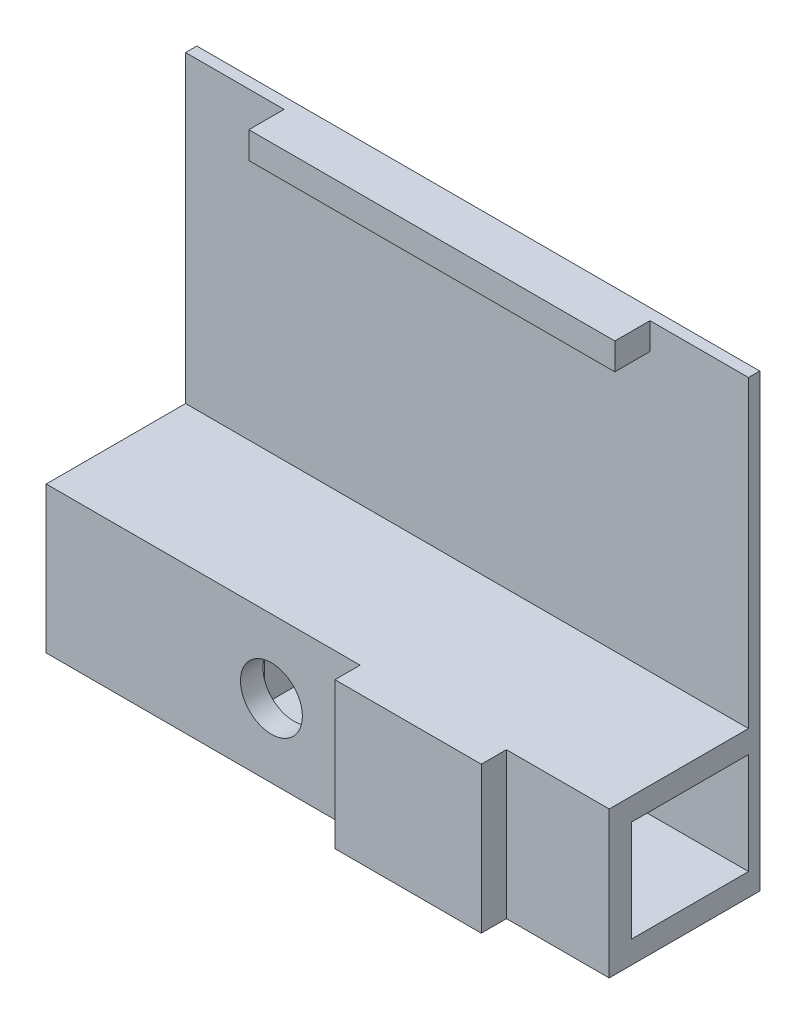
ISO-10303-21;
HEADER;
FILE_DESCRIPTION(('STEP AP214'),'2;1');
FILE_NAME('part.step','',(''),(''),'','','');
FILE_SCHEMA(('AUTOMOTIVE_DESIGN { 1 0 10303 214 1 1 1 1 }'));
ENDSEC;
DATA;
#1=APPLICATION_CONTEXT('core data for automotive mechanical design processes');
#2=APPLICATION_PROTOCOL_DEFINITION('international standard','automotive_design',2000,#1);
#3=PRODUCT_CONTEXT('',#1,'mechanical');
#4=PRODUCT('Part','Part','',(#3));
#5=PRODUCT_RELATED_PRODUCT_CATEGORY('part','',(#4));
#6=PRODUCT_DEFINITION_FORMATION('','',#4);
#7=PRODUCT_DEFINITION_CONTEXT('part definition',#1,'design');
#8=PRODUCT_DEFINITION('design','',#6,#7);
#9=PRODUCT_DEFINITION_SHAPE('','',#8);
#10=(LENGTH_UNIT() NAMED_UNIT(*) SI_UNIT(.MILLI.,.METRE.));
#11=(NAMED_UNIT(*) PLANE_ANGLE_UNIT() SI_UNIT($,.RADIAN.));
#12=(NAMED_UNIT(*) SI_UNIT($,.STERADIAN.) SOLID_ANGLE_UNIT());
#13=UNCERTAINTY_MEASURE_WITH_UNIT(LENGTH_MEASURE(1.E-05),#10,'distance_accuracy_value','');
#14=(GEOMETRIC_REPRESENTATION_CONTEXT(3) GLOBAL_UNCERTAINTY_ASSIGNED_CONTEXT((#13)) GLOBAL_UNIT_ASSIGNED_CONTEXT((#10,
#11,#12)) REPRESENTATION_CONTEXT('',''));
#15=CARTESIAN_POINT('',(0.,0.,0.));
#16=DIRECTION('',(0.,0.,1.));
#17=DIRECTION('',(1.,0.,0.));
#18=AXIS2_PLACEMENT_3D('',#15,#16,#17);
#19=CARTESIAN_POINT('',(-160.,-52.,8.));
#20=DIRECTION('',(0.,0.,1.));
#21=DIRECTION('',(1.,0.,0.));
#22=AXIS2_PLACEMENT_3D('',#19,#20,#21);
#23=PLANE('',#22);
#24=DIRECTION('',(1.,0.,0.));
#25=VECTOR('',#24,1.);
#26=CARTESIAN_POINT('',(-90.,249.,8.));
#27=LINE('',#26,#25);
#28=CARTESIAN_POINT('',(-90.,249.,8.));
#29=VERTEX_POINT('',#28);
#30=CARTESIAN_POINT('',(170.,249.,8.));
#31=VERTEX_POINT('',#30);
#32=EDGE_CURVE('E52',#29,#31,#27,.T.);
#33=ORIENTED_EDGE('',*,*,#32,.F.);
#34=DIRECTION('',(0.,-1.,0.));
#35=VECTOR('',#34,1.);
#36=CARTESIAN_POINT('',(-90.,268.,8.));
#37=LINE('',#36,#35);
#38=CARTESIAN_POINT('',(-90.,268.,8.));
#39=VERTEX_POINT('',#38);
#40=EDGE_CURVE('E294',#39,#29,#37,.T.);
#41=ORIENTED_EDGE('',*,*,#40,.F.);
#42=DIRECTION('',(-1.,0.,0.));
#43=VECTOR('',#42,1.);
#44=CARTESIAN_POINT('',(-160.,268.,8.));
#45=LINE('',#44,#43);
#46=CARTESIAN_POINT('',(-160.,268.,8.));
#47=VERTEX_POINT('',#46);
#48=EDGE_CURVE('E280',#39,#47,#45,.T.);
#49=ORIENTED_EDGE('',*,*,#48,.T.);
#50=DIRECTION('',(0.,-1.,0.));
#51=VECTOR('',#50,1.);
#52=CARTESIAN_POINT('',(-160.,268.,8.));
#53=LINE('',#52,#51);
#54=CARTESIAN_POINT('',(-160.,52.,8.));
#55=VERTEX_POINT('',#54);
#56=EDGE_CURVE('E548',#47,#55,#53,.T.);
#57=ORIENTED_EDGE('',*,*,#56,.T.);
#58=DIRECTION('',(-1.,0.,0.));
#59=VECTOR('',#58,1.);
#60=CARTESIAN_POINT('',(240.,52.,8.));
#61=LINE('',#60,#59);
#62=CARTESIAN_POINT('',(240.,52.,8.));
#63=VERTEX_POINT('',#62);
#64=EDGE_CURVE('E517',#63,#55,#61,.T.);
#65=ORIENTED_EDGE('',*,*,#64,.F.);
#66=DIRECTION('',(0.,1.,0.));
#67=VECTOR('',#66,1.);
#68=CARTESIAN_POINT('',(240.,268.,8.));
#69=LINE('',#68,#67);
#70=CARTESIAN_POINT('',(240.,268.,8.));
#71=VERTEX_POINT('',#70);
#72=EDGE_CURVE('E546',#63,#71,#69,.T.);
#73=ORIENTED_EDGE('',*,*,#72,.T.);
#74=CARTESIAN_POINT('',(170.,268.,8.));
#75=VERTEX_POINT('',#74);
#76=EDGE_CURVE('E290',#71,#75,#45,.T.);
#77=ORIENTED_EDGE('',*,*,#76,.T.);
#78=DIRECTION('',(0.,1.,0.));
#79=VECTOR('',#78,1.);
#80=CARTESIAN_POINT('',(170.,268.,8.));
#81=LINE('',#80,#79);
#82=EDGE_CURVE('E57',#31,#75,#81,.T.);
#83=ORIENTED_EDGE('',*,*,#82,.F.);
#84=EDGE_LOOP('',(#33,#41,#49,#57,#65,#73,#77,#83));
#85=FACE_BOUND('',#84,.T.);
#86=ADVANCED_FACE('F35',(#85),#23,.T.);
#87=CARTESIAN_POINT('',(240.,52.,107.));
#88=DIRECTION('',(0.,0.,-1.));
#89=DIRECTION('',(0.,1.,0.));
#90=AXIS2_PLACEMENT_3D('',#87,#88,#89);
#91=PLANE('',#90);
#92=CARTESIAN_POINT('',(0.,0.,107.));
#93=DIRECTION('',(0.,0.,1.));
#94=DIRECTION('',(1.,0.,0.));
#95=AXIS2_PLACEMENT_3D('',#92,#93,#94);
#96=CIRCLE('',#95,22.);
#97=CARTESIAN_POINT('',(22.,0.,107.));
#98=VERTEX_POINT('',#97);
#99=EDGE_CURVE('E418',#98,#98,#96,.T.);
#100=ORIENTED_EDGE('',*,*,#99,.F.);
#101=EDGE_LOOP('',(#100));
#102=FACE_BOUND('',#101,.T.);
#103=DIRECTION('',(0.,-1.,0.));
#104=VECTOR('',#103,1.);
#105=CARTESIAN_POINT('',(63.,52.,107.));
#106=LINE('',#105,#104);
#107=CARTESIAN_POINT('',(63.,52.,107.));
#108=VERTEX_POINT('',#107);
#109=CARTESIAN_POINT('',(63.,-52.,107.));
#110=VERTEX_POINT('',#109);
#111=EDGE_CURVE('E315',#108,#110,#106,.T.);
#112=ORIENTED_EDGE('',*,*,#111,.F.);
#113=DIRECTION('',(-1.,0.,0.));
#114=VECTOR('',#113,1.);
#115=CARTESIAN_POINT('',(240.,52.,107.));
#116=LINE('',#115,#114);
#117=CARTESIAN_POINT('',(-160.,52.,107.));
#118=VERTEX_POINT('',#117);
#119=EDGE_CURVE('E514',#108,#118,#116,.T.);
#120=ORIENTED_EDGE('',*,*,#119,.T.);
#121=DIRECTION('',(0.,-1.,0.));
#122=VECTOR('',#121,1.);
#123=CARTESIAN_POINT('',(-160.,52.,107.));
#124=LINE('',#123,#122);
#125=CARTESIAN_POINT('',(-160.,-52.,107.));
#126=VERTEX_POINT('',#125);
#127=EDGE_CURVE('E467',#118,#126,#124,.T.);
#128=ORIENTED_EDGE('',*,*,#127,.T.);
#129=DIRECTION('',(-1.,0.,0.));
#130=VECTOR('',#129,1.);
#131=CARTESIAN_POINT('',(240.,-52.,107.));
#132=LINE('',#131,#130);
#133=EDGE_CURVE('E501',#110,#126,#132,.T.);
#134=ORIENTED_EDGE('',*,*,#133,.F.);
#135=EDGE_LOOP('',(#112,#120,#128,#134));
#136=FACE_BOUND('',#135,.T.);
#137=ADVANCED_FACE('F579',(#102,#136),#91,.F.);
#138=DIRECTION('',(0.,1.,0.));
#139=VECTOR('',#138,1.);
#140=CARTESIAN_POINT('',(167.,52.,107.));
#141=LINE('',#140,#139);
#142=CARTESIAN_POINT('',(167.,-52.,107.));
#143=VERTEX_POINT('',#142);
#144=CARTESIAN_POINT('',(167.,52.,107.));
#145=VERTEX_POINT('',#144);
#146=EDGE_CURVE('E323',#143,#145,#141,.T.);
#147=ORIENTED_EDGE('',*,*,#146,.F.);
#148=CARTESIAN_POINT('',(240.,-52.,107.));
#149=VERTEX_POINT('',#148);
#150=EDGE_CURVE('E511',#149,#143,#132,.T.);
#151=ORIENTED_EDGE('',*,*,#150,.F.);
#152=DIRECTION('',(0.,-1.,0.));
#153=VECTOR('',#152,1.);
#154=CARTESIAN_POINT('',(240.,52.,107.));
#155=LINE('',#154,#153);
#156=CARTESIAN_POINT('',(240.,52.,107.));
#157=VERTEX_POINT('',#156);
#158=EDGE_CURVE('E480',#157,#149,#155,.T.);
#159=ORIENTED_EDGE('',*,*,#158,.F.);
#160=EDGE_CURVE('E516',#157,#145,#116,.T.);
#161=ORIENTED_EDGE('',*,*,#160,.T.);
#162=EDGE_LOOP('',(#147,#151,#159,#161));
#163=FACE_BOUND('',#162,.T.);
#164=ADVANCED_FACE('F602',(#163),#91,.F.);
#165=CARTESIAN_POINT('',(240.,36.,91.));
#166=DIRECTION('',(0.,0.,1.));
#167=DIRECTION('',(0.,-1.,0.));
#168=AXIS2_PLACEMENT_3D('',#165,#166,#167);
#169=PLANE('',#168);
#170=DIRECTION('',(-1.,0.,0.));
#171=VECTOR('',#170,1.);
#172=CARTESIAN_POINT('',(240.,-36.,91.));
#173=LINE('',#172,#171);
#174=CARTESIAN_POINT('',(240.,-36.,91.));
#175=VERTEX_POINT('',#174);
#176=CARTESIAN_POINT('',(-160.,-36.,91.));
#177=VERTEX_POINT('',#176);
#178=EDGE_CURVE('E496',#175,#177,#173,.T.);
#179=ORIENTED_EDGE('',*,*,#178,.T.);
#180=DIRECTION('',(0.,1.,0.));
#181=VECTOR('',#180,1.);
#182=CARTESIAN_POINT('',(-160.,36.,91.));
#183=LINE('',#182,#181);
#184=CARTESIAN_POINT('',(-160.,36.,91.));
#185=VERTEX_POINT('',#184);
#186=EDGE_CURVE('E473',#177,#185,#183,.T.);
#187=ORIENTED_EDGE('',*,*,#186,.T.);
#188=DIRECTION('',(-1.,0.,0.));
#189=VECTOR('',#188,1.);
#190=CARTESIAN_POINT('',(240.,36.,91.));
#191=LINE('',#190,#189);
#192=CARTESIAN_POINT('',(240.,36.,91.));
#193=VERTEX_POINT('',#192);
#194=EDGE_CURVE('E493',#193,#185,#191,.T.);
#195=ORIENTED_EDGE('',*,*,#194,.F.);
#196=DIRECTION('',(0.,1.,0.));
#197=VECTOR('',#196,1.);
#198=CARTESIAN_POINT('',(240.,36.,91.));
#199=LINE('',#198,#197);
#200=EDGE_CURVE('E485',#175,#193,#199,.T.);
#201=ORIENTED_EDGE('',*,*,#200,.F.);
#202=EDGE_LOOP('',(#179,#187,#195,#201));
#203=FACE_BOUND('',#202,.T.);
#204=DIRECTION('',(0.,1.,0.));
#205=VECTOR('',#204,1.);
#206=CARTESIAN_POINT('',(21.,22.,91.));
#207=LINE('',#206,#205);
#208=CARTESIAN_POINT('',(21.,-22.,91.));
#209=VERTEX_POINT('',#208);
#210=CARTESIAN_POINT('',(21.,-6.55743852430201,91.));
#211=VERTEX_POINT('',#210);
#212=EDGE_CURVE('E356',#209,#211,#207,.T.);
#213=ORIENTED_EDGE('',*,*,#212,.F.);
#214=DIRECTION('',(-1.,0.,0.));
#215=VECTOR('',#214,1.);
#216=CARTESIAN_POINT('',(21.,-22.,91.));
#217=LINE('',#216,#215);
#218=CARTESIAN_POINT('',(37.,-22.,91.));
#219=VERTEX_POINT('',#218);
#220=EDGE_CURVE('E352',#219,#209,#217,.T.);
#221=ORIENTED_EDGE('',*,*,#220,.F.);
#222=DIRECTION('',(0.,-1.,0.));
#223=VECTOR('',#222,1.);
#224=CARTESIAN_POINT('',(37.,22.,91.));
#225=LINE('',#224,#223);
#226=CARTESIAN_POINT('',(37.,22.,91.));
#227=VERTEX_POINT('',#226);
#228=EDGE_CURVE('E348',#227,#219,#225,.T.);
#229=ORIENTED_EDGE('',*,*,#228,.F.);
#230=DIRECTION('',(1.,0.,0.));
#231=VECTOR('',#230,1.);
#232=CARTESIAN_POINT('',(21.,22.,91.));
#233=LINE('',#232,#231);
#234=CARTESIAN_POINT('',(21.,22.,91.));
#235=VERTEX_POINT('',#234);
#236=EDGE_CURVE('E345',#235,#227,#233,.T.);
#237=ORIENTED_EDGE('',*,*,#236,.F.);
#238=CARTESIAN_POINT('',(21.,6.55743852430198,91.));
#239=VERTEX_POINT('',#238);
#240=EDGE_CURVE('E355',#239,#235,#207,.T.);
#241=ORIENTED_EDGE('',*,*,#240,.F.);
#242=CARTESIAN_POINT('',(0.,0.,91.));
#243=DIRECTION('',(0.,0.,1.));
#244=DIRECTION('',(0.,-1.,0.));
#245=AXIS2_PLACEMENT_3D('',#242,#243,#244);
#246=CIRCLE('',#245,22.);
#247=CARTESIAN_POINT('',(-21.,6.55743852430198,91.));
#248=VERTEX_POINT('',#247);
#249=EDGE_CURVE('E425',#239,#248,#246,.T.);
#250=ORIENTED_EDGE('',*,*,#249,.T.);
#251=DIRECTION('',(0.,-1.,0.));
#252=VECTOR('',#251,1.);
#253=CARTESIAN_POINT('',(-21.,22.,91.));
#254=LINE('',#253,#252);
#255=CARTESIAN_POINT('',(-21.,22.,91.));
#256=VERTEX_POINT('',#255);
#257=EDGE_CURVE('E382',#256,#248,#254,.T.);
#258=ORIENTED_EDGE('',*,*,#257,.F.);
#259=DIRECTION('',(1.,0.,0.));
#260=VECTOR('',#259,1.);
#261=CARTESIAN_POINT('',(-21.,22.,91.));
#262=LINE('',#261,#260);
#263=CARTESIAN_POINT('',(-37.,22.,91.));
#264=VERTEX_POINT('',#263);
#265=EDGE_CURVE('E393',#264,#256,#262,.T.);
#266=ORIENTED_EDGE('',*,*,#265,.F.);
#267=DIRECTION('',(0.,1.,0.));
#268=VECTOR('',#267,1.);
#269=CARTESIAN_POINT('',(-37.,22.,91.));
#270=LINE('',#269,#268);
#271=CARTESIAN_POINT('',(-37.,-22.,91.));
#272=VERTEX_POINT('',#271);
#273=EDGE_CURVE('E390',#272,#264,#270,.T.);
#274=ORIENTED_EDGE('',*,*,#273,.F.);
#275=DIRECTION('',(-1.,0.,0.));
#276=VECTOR('',#275,1.);
#277=CARTESIAN_POINT('',(-21.,-22.,91.));
#278=LINE('',#277,#276);
#279=CARTESIAN_POINT('',(-21.,-22.,91.));
#280=VERTEX_POINT('',#279);
#281=EDGE_CURVE('E385',#280,#272,#278,.T.);
#282=ORIENTED_EDGE('',*,*,#281,.F.);
#283=CARTESIAN_POINT('',(-21.,-6.55743852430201,91.));
#284=VERTEX_POINT('',#283);
#285=EDGE_CURVE('E387',#284,#280,#254,.T.);
#286=ORIENTED_EDGE('',*,*,#285,.F.);
#287=EDGE_CURVE('E431',#284,#211,#246,.T.);
#288=ORIENTED_EDGE('',*,*,#287,.T.);
#289=EDGE_LOOP('',(#213,#221,#229,#237,#241,#250,#258,#266,#274,#282,#286,#288));
#290=FACE_BOUND('',#289,.T.);
#291=ADVANCED_FACE('F683',(#203,#290),#169,.F.);
#292=CARTESIAN_POINT('',(110.,36.,31.));
#293=DIRECTION('',(0.,0.,-1.));
#294=DIRECTION('',(0.,1.,0.));
#295=AXIS2_PLACEMENT_3D('',#292,#293,#294);
#296=PLANE('',#295);
#297=DIRECTION('',(-1.,0.,0.));
#298=VECTOR('',#297,1.);
#299=CARTESIAN_POINT('',(110.,36.,31.));
#300=LINE('',#299,#298);
#301=CARTESIAN_POINT('',(110.,36.,31.));
#302=VERTEX_POINT('',#301);
#303=CARTESIAN_POINT('',(-110.,36.,31.));
#304=VERTEX_POINT('',#303);
#305=EDGE_CURVE('E454',#302,#304,#300,.T.);
#306=ORIENTED_EDGE('',*,*,#305,.T.);
#307=DIRECTION('',(0.,-1.,0.));
#308=VECTOR('',#307,1.);
#309=CARTESIAN_POINT('',(-110.,36.,31.));
#310=LINE('',#309,#308);
#311=CARTESIAN_POINT('',(-110.,-36.,31.));
#312=VERTEX_POINT('',#311);
#313=EDGE_CURVE('E430',#304,#312,#310,.T.);
#314=ORIENTED_EDGE('',*,*,#313,.T.);
#315=DIRECTION('',(-1.,0.,0.));
#316=VECTOR('',#315,1.);
#317=CARTESIAN_POINT('',(110.,-36.,31.));
#318=LINE('',#317,#316);
#319=CARTESIAN_POINT('',(110.,-36.,31.));
#320=VERTEX_POINT('',#319);
#321=EDGE_CURVE('E462',#320,#312,#318,.T.);
#322=ORIENTED_EDGE('',*,*,#321,.F.);
#323=DIRECTION('',(0.,-1.,0.));
#324=VECTOR('',#323,1.);
#325=CARTESIAN_POINT('',(110.,36.,31.));
#326=LINE('',#325,#324);
#327=EDGE_CURVE('E442',#302,#320,#326,.T.);
#328=ORIENTED_EDGE('',*,*,#327,.F.);
#329=EDGE_LOOP('',(#306,#314,#322,#328));
#330=FACE_BOUND('',#329,.T.);
#331=DIRECTION('',(0.,-1.,0.));
#332=VECTOR('',#331,1.);
#333=CARTESIAN_POINT('',(21.,36.,31.));
#334=LINE('',#333,#332);
#335=CARTESIAN_POINT('',(21.,22.,31.));
#336=VERTEX_POINT('',#335);
#337=CARTESIAN_POINT('',(21.,6.55743852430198,31.));
#338=VERTEX_POINT('',#337);
#339=EDGE_CURVE('E379',#336,#338,#334,.T.);
#340=ORIENTED_EDGE('',*,*,#339,.F.);
#341=DIRECTION('',(-1.,0.,0.));
#342=VECTOR('',#341,1.);
#343=CARTESIAN_POINT('',(110.,22.,31.));
#344=LINE('',#343,#342);
#345=CARTESIAN_POINT('',(37.,22.,31.));
#346=VERTEX_POINT('',#345);
#347=EDGE_CURVE('E11',#346,#336,#344,.T.);
#348=ORIENTED_EDGE('',*,*,#347,.F.);
#349=DIRECTION('',(0.,1.,0.));
#350=VECTOR('',#349,1.);
#351=CARTESIAN_POINT('',(37.,36.,31.));
#352=LINE('',#351,#350);
#353=CARTESIAN_POINT('',(37.,-22.,31.));
#354=VERTEX_POINT('',#353);
#355=EDGE_CURVE('E44',#354,#346,#352,.T.);
#356=ORIENTED_EDGE('',*,*,#355,.F.);
#357=DIRECTION('',(1.,0.,0.));
#358=VECTOR('',#357,1.);
#359=CARTESIAN_POINT('',(110.,-22.,31.));
#360=LINE('',#359,#358);
#361=CARTESIAN_POINT('',(21.,-22.,31.));
#362=VERTEX_POINT('',#361);
#363=EDGE_CURVE('E520',#362,#354,#360,.T.);
#364=ORIENTED_EDGE('',*,*,#363,.F.);
#365=CARTESIAN_POINT('',(21.,-6.55743852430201,31.));
#366=VERTEX_POINT('',#365);
#367=EDGE_CURVE('E376',#366,#362,#334,.T.);
#368=ORIENTED_EDGE('',*,*,#367,.F.);
#369=CARTESIAN_POINT('',(0.,0.,31.));
#370=DIRECTION('',(0.,0.,-1.));
#371=DIRECTION('',(0.,1.,0.));
#372=AXIS2_PLACEMENT_3D('',#369,#370,#371);
#373=CIRCLE('',#372,22.);
#374=CARTESIAN_POINT('',(-21.,-6.55743852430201,31.));
#375=VERTEX_POINT('',#374);
#376=EDGE_CURVE('E426',#366,#375,#373,.T.);
#377=ORIENTED_EDGE('',*,*,#376,.T.);
#378=DIRECTION('',(0.,1.,0.));
#379=VECTOR('',#378,1.);
#380=CARTESIAN_POINT('',(-21.,36.,31.));
#381=LINE('',#380,#379);
#382=CARTESIAN_POINT('',(-21.,-22.,31.));
#383=VERTEX_POINT('',#382);
#384=EDGE_CURVE('E415',#383,#375,#381,.T.);
#385=ORIENTED_EDGE('',*,*,#384,.F.);
#386=DIRECTION('',(1.,0.,0.));
#387=VECTOR('',#386,1.);
#388=CARTESIAN_POINT('',(110.,-22.,31.));
#389=LINE('',#388,#387);
#390=CARTESIAN_POINT('',(-37.,-22.,31.));
#391=VERTEX_POINT('',#390);
#392=EDGE_CURVE('E525',#391,#383,#389,.T.);
#393=ORIENTED_EDGE('',*,*,#392,.F.);
#394=DIRECTION('',(0.,-1.,0.));
#395=VECTOR('',#394,1.);
#396=CARTESIAN_POINT('',(-37.,36.,31.));
#397=LINE('',#396,#395);
#398=CARTESIAN_POINT('',(-37.,22.,31.));
#399=VERTEX_POINT('',#398);
#400=EDGE_CURVE('E527',#399,#391,#397,.T.);
#401=ORIENTED_EDGE('',*,*,#400,.F.);
#402=DIRECTION('',(-1.,0.,0.));
#403=VECTOR('',#402,1.);
#404=CARTESIAN_POINT('',(110.,22.,31.));
#405=LINE('',#404,#403);
#406=CARTESIAN_POINT('',(-21.,22.,31.));
#407=VERTEX_POINT('',#406);
#408=EDGE_CURVE('E529',#407,#399,#405,.T.);
#409=ORIENTED_EDGE('',*,*,#408,.F.);
#410=CARTESIAN_POINT('',(-21.,6.55743852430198,31.));
#411=VERTEX_POINT('',#410);
#412=EDGE_CURVE('E412',#411,#407,#381,.T.);
#413=ORIENTED_EDGE('',*,*,#412,.F.);
#414=EDGE_CURVE('E422',#411,#338,#373,.T.);
#415=ORIENTED_EDGE('',*,*,#414,.T.);
#416=EDGE_LOOP('',(#340,#348,#356,#364,#368,#377,#385,#393,#401,#409,#413,#415));
#417=FACE_BOUND('',#416,.T.);
#418=ADVANCED_FACE('F707',(#330,#417),#296,.F.);
#419=CARTESIAN_POINT('',(0.,0.,0.));
#420=DIRECTION('',(0.,0.,1.));
#421=DIRECTION('',(1.,0.,0.));
#422=AXIS2_PLACEMENT_3D('',#419,#420,#421);
#423=CYLINDRICAL_SURFACE('',#422,22.);
#424=CARTESIAN_POINT('',(0.,0.,16.));
#425=DIRECTION('',(0.,0.,1.));
#426=DIRECTION('',(0.,-1.,0.));
#427=AXIS2_PLACEMENT_3D('',#424,#425,#426);
#428=CIRCLE('',#427,22.);
#429=CARTESIAN_POINT('',(0.,-22.,16.));
#430=VERTEX_POINT('',#429);
#431=EDGE_CURVE('E421',#430,#430,#428,.T.);
#432=ORIENTED_EDGE('',*,*,#431,.F.);
#433=EDGE_LOOP('',(#432));
#434=FACE_BOUND('',#433,.T.);
#435=DIRECTION('',(0.,0.,1.));
#436=VECTOR('',#435,1.);
#437=CARTESIAN_POINT('',(21.,6.55743852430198,0.));
#438=LINE('',#437,#436);
#439=CARTESIAN_POINT('',(21.,6.55743852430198,24.5));
#440=VERTEX_POINT('',#439);
#441=EDGE_CURVE('E378',#338,#440,#438,.F.);
#442=ORIENTED_EDGE('',*,*,#441,.F.);
#443=ORIENTED_EDGE('',*,*,#414,.F.);
#444=DIRECTION('',(0.,0.,1.));
#445=VECTOR('',#444,1.);
#446=CARTESIAN_POINT('',(-21.,6.55743852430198,0.));
#447=LINE('',#446,#445);
#448=CARTESIAN_POINT('',(-21.,6.55743852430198,24.5));
#449=VERTEX_POINT('',#448);
#450=EDGE_CURVE('E410',#449,#411,#447,.T.);
#451=ORIENTED_EDGE('',*,*,#450,.F.);
#452=CARTESIAN_POINT('',(0.,0.,24.5));
#453=DIRECTION('',(0.,0.,-1.));
#454=DIRECTION('',(-1.,0.,0.));
#455=AXIS2_PLACEMENT_3D('',#452,#453,#454);
#456=CIRCLE('',#455,22.);
#457=CARTESIAN_POINT('',(-21.,-6.55743852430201,24.5));
#458=VERTEX_POINT('',#457);
#459=EDGE_CURVE('E531',#449,#458,#456,.F.);
#460=ORIENTED_EDGE('',*,*,#459,.T.);
#461=DIRECTION('',(0.,0.,1.));
#462=VECTOR('',#461,1.);
#463=CARTESIAN_POINT('',(-21.,-6.55743852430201,0.));
#464=LINE('',#463,#462);
#465=EDGE_CURVE('E414',#375,#458,#464,.F.);
#466=ORIENTED_EDGE('',*,*,#465,.F.);
#467=ORIENTED_EDGE('',*,*,#376,.F.);
#468=DIRECTION('',(0.,0.,1.));
#469=VECTOR('',#468,1.);
#470=CARTESIAN_POINT('',(21.,-6.55743852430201,0.));
#471=LINE('',#470,#469);
#472=CARTESIAN_POINT('',(21.,-6.55743852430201,24.5));
#473=VERTEX_POINT('',#472);
#474=EDGE_CURVE('E374',#473,#366,#471,.T.);
#475=ORIENTED_EDGE('',*,*,#474,.F.);
#476=CARTESIAN_POINT('',(0.,0.,24.5));
#477=DIRECTION('',(0.,0.,-1.));
#478=DIRECTION('',(-1.,0.,0.));
#479=AXIS2_PLACEMENT_3D('',#476,#477,#478);
#480=CIRCLE('',#479,22.);
#481=EDGE_CURVE('E522',#473,#440,#480,.F.);
#482=ORIENTED_EDGE('',*,*,#481,.T.);
#483=EDGE_LOOP('',(#442,#443,#451,#460,#466,#467,#475,#482));
#484=FACE_BOUND('',#483,.T.);
#485=ADVANCED_FACE('F643',(#434,#484),#423,.F.);
#486=CARTESIAN_POINT('',(-160.,36.,7.99999999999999));
#487=VERTEX_POINT('',#486);
#488=CARTESIAN_POINT('',(-160.,-36.,7.99999999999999));
#489=VERTEX_POINT('',#488);
#490=EDGE_CURVE('E550',#487,#489,#53,.T.);
#491=ORIENTED_EDGE('',*,*,#490,.T.);
#492=DIRECTION('',(-1.,0.,0.));
#493=VECTOR('',#492,1.);
#494=CARTESIAN_POINT('',(240.,-36.,7.99999999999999));
#495=LINE('',#494,#493);
#496=CARTESIAN_POINT('',(-10.5,-36.,7.99999999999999));
#497=VERTEX_POINT('',#496);
#498=EDGE_CURVE('E498',#497,#489,#495,.T.);
#499=ORIENTED_EDGE('',*,*,#498,.F.);
#500=CARTESIAN_POINT('',(0.,0.,8.));
#501=DIRECTION('',(0.,0.,1.));
#502=DIRECTION('',(1.,0.,0.));
#503=AXIS2_PLACEMENT_3D('',#500,#501,#502);
#504=CIRCLE('',#503,37.5);
#505=CARTESIAN_POINT('',(-10.5,36.,7.99999999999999));
#506=VERTEX_POINT('',#505);
#507=EDGE_CURVE('E563',#506,#497,#504,.T.);
#508=ORIENTED_EDGE('',*,*,#507,.F.);
#509=DIRECTION('',(-1.,0.,0.));
#510=VECTOR('',#509,1.);
#511=CARTESIAN_POINT('',(240.,36.,7.99999999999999));
#512=LINE('',#511,#510);
#513=EDGE_CURVE('E489',#506,#487,#512,.T.);
#514=ORIENTED_EDGE('',*,*,#513,.T.);
#515=EDGE_LOOP('',(#491,#499,#508,#514));
#516=FACE_BOUND('',#515,.T.);
#517=ADVANCED_FACE('F633',(#516),#23,.T.);
#518=CARTESIAN_POINT('',(10.5000000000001,-36.,7.99999999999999));
#519=VERTEX_POINT('',#518);
#520=CARTESIAN_POINT('',(10.5,36.,7.99999999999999));
#521=VERTEX_POINT('',#520);
#522=EDGE_CURVE('E564',#519,#521,#504,.T.);
#523=ORIENTED_EDGE('',*,*,#522,.F.);
#524=CARTESIAN_POINT('',(240.,-36.,7.99999999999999));
#525=VERTEX_POINT('',#524);
#526=EDGE_CURVE('E499',#525,#519,#495,.T.);
#527=ORIENTED_EDGE('',*,*,#526,.F.);
#528=CARTESIAN_POINT('',(240.,36.,7.99999999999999));
#529=VERTEX_POINT('',#528);
#530=EDGE_CURVE('E291',#525,#529,#69,.T.);
#531=ORIENTED_EDGE('',*,*,#530,.T.);
#532=EDGE_CURVE('E490',#529,#521,#512,.T.);
#533=ORIENTED_EDGE('',*,*,#532,.T.);
#534=EDGE_LOOP('',(#523,#527,#531,#533));
#535=FACE_BOUND('',#534,.T.);
#536=ADVANCED_FACE('F634',(#535),#23,.T.);
#537=CARTESIAN_POINT('',(-160.,-52.,0.));
#538=DIRECTION('',(0.,0.,1.));
#539=DIRECTION('',(1.,0.,0.));
#540=AXIS2_PLACEMENT_3D('',#537,#538,#539);
#541=PLANE('',#540);
#542=DIRECTION('',(0.,-1.,0.));
#543=VECTOR('',#542,1.);
#544=CARTESIAN_POINT('',(-160.,268.,0.));
#545=LINE('',#544,#543);
#546=CARTESIAN_POINT('',(-160.,268.,0.));
#547=VERTEX_POINT('',#546);
#548=CARTESIAN_POINT('',(-160.,-52.,0.));
#549=VERTEX_POINT('',#548);
#550=EDGE_CURVE('E557',#547,#549,#545,.T.);
#551=ORIENTED_EDGE('',*,*,#550,.F.);
#552=DIRECTION('',(-1.,0.,0.));
#553=VECTOR('',#552,1.);
#554=CARTESIAN_POINT('',(-160.,268.,0.));
#555=LINE('',#554,#553);
#556=CARTESIAN_POINT('',(240.,268.,0.));
#557=VERTEX_POINT('',#556);
#558=EDGE_CURVE('E551',#557,#547,#555,.T.);
#559=ORIENTED_EDGE('',*,*,#558,.F.);
#560=DIRECTION('',(0.,1.,0.));
#561=VECTOR('',#560,1.);
#562=CARTESIAN_POINT('',(240.,268.,0.));
#563=LINE('',#562,#561);
#564=CARTESIAN_POINT('',(240.,-52.,0.));
#565=VERTEX_POINT('',#564);
#566=EDGE_CURVE('E553',#565,#557,#563,.T.);
#567=ORIENTED_EDGE('',*,*,#566,.F.);
#568=DIRECTION('',(1.,0.,0.));
#569=VECTOR('',#568,1.);
#570=CARTESIAN_POINT('',(-160.,-52.,0.));
#571=LINE('',#570,#569);
#572=EDGE_CURVE('E555',#549,#565,#571,.T.);
#573=ORIENTED_EDGE('',*,*,#572,.F.);
#574=EDGE_LOOP('',(#551,#559,#567,#573));
#575=FACE_BOUND('',#574,.T.);
#576=CARTESIAN_POINT('',(0.,0.,0.));
#577=DIRECTION('',(0.,0.,1.));
#578=DIRECTION('',(1.,0.,0.));
#579=AXIS2_PLACEMENT_3D('',#576,#577,#578);
#580=CIRCLE('',#579,37.5);
#581=CARTESIAN_POINT('',(37.5,0.,0.));
#582=VERTEX_POINT('',#581);
#583=EDGE_CURVE('E565',#582,#582,#580,.T.);
#584=ORIENTED_EDGE('',*,*,#583,.T.);
#585=EDGE_LOOP('',(#584));
#586=FACE_BOUND('',#585,.T.);
#587=ADVANCED_FACE('F646',(#575,#586),#541,.F.);
#588=CARTESIAN_POINT('',(-160.,268.,8.));
#589=DIRECTION('',(1.,0.,0.));
#590=DIRECTION('',(0.,1.,0.));
#591=AXIS2_PLACEMENT_3D('',#588,#589,#590);
#592=PLANE('',#591);
#593=DIRECTION('',(0.,0.,1.));
#594=VECTOR('',#593,1.);
#595=CARTESIAN_POINT('',(-160.,52.,8.));
#596=LINE('',#595,#594);
#597=EDGE_CURVE('E464',#55,#118,#596,.T.);
#598=ORIENTED_EDGE('',*,*,#597,.F.);
#599=ORIENTED_EDGE('',*,*,#56,.F.);
#600=DIRECTION('',(0.,0.,-1.));
#601=VECTOR('',#600,1.);
#602=CARTESIAN_POINT('',(-160.,268.,8.));
#603=LINE('',#602,#601);
#604=EDGE_CURVE('E287',#47,#547,#603,.T.);
#605=ORIENTED_EDGE('',*,*,#604,.T.);
#606=ORIENTED_EDGE('',*,*,#550,.T.);
#607=DIRECTION('',(0.,0.,-1.));
#608=VECTOR('',#607,1.);
#609=CARTESIAN_POINT('',(-160.,-52.,8.));
#610=LINE('',#609,#608);
#611=EDGE_CURVE('E534',#126,#549,#610,.T.);
#612=ORIENTED_EDGE('',*,*,#611,.F.);
#613=ORIENTED_EDGE('',*,*,#127,.F.);
#614=EDGE_LOOP('',(#598,#599,#605,#606,#612,#613));
#615=FACE_BOUND('',#614,.T.);
#616=ORIENTED_EDGE('',*,*,#490,.F.);
#617=DIRECTION('',(0.,0.,-1.));
#618=VECTOR('',#617,1.);
#619=CARTESIAN_POINT('',(-160.,36.,7.99999999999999));
#620=LINE('',#619,#618);
#621=EDGE_CURVE('E476',#185,#487,#620,.T.);
#622=ORIENTED_EDGE('',*,*,#621,.F.);
#623=ORIENTED_EDGE('',*,*,#186,.F.);
#624=DIRECTION('',(0.,0.,1.));
#625=VECTOR('',#624,1.);
#626=CARTESIAN_POINT('',(-160.,-36.,7.99999999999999));
#627=LINE('',#626,#625);
#628=EDGE_CURVE('E470',#489,#177,#627,.T.);
#629=ORIENTED_EDGE('',*,*,#628,.F.);
#630=EDGE_LOOP('',(#616,#622,#623,#629));
#631=FACE_BOUND('',#630,.T.);
#632=ADVANCED_FACE('F37',(#615,#631),#592,.F.);
#633=CARTESIAN_POINT('',(-160.,-52.,8.));
#634=DIRECTION('',(0.,1.,0.));
#635=DIRECTION('',(-1.,0.,0.));
#636=AXIS2_PLACEMENT_3D('',#633,#634,#635);
#637=PLANE('',#636);
#638=ORIENTED_EDGE('',*,*,#572,.T.);
#639=DIRECTION('',(0.,0.,-1.));
#640=VECTOR('',#639,1.);
#641=CARTESIAN_POINT('',(240.,-52.,8.));
#642=LINE('',#641,#640);
#643=EDGE_CURVE('E539',#149,#565,#642,.T.);
#644=ORIENTED_EDGE('',*,*,#643,.F.);
#645=ORIENTED_EDGE('',*,*,#150,.T.);
#646=DIRECTION('',(0.,0.,-1.));
#647=VECTOR('',#646,1.);
#648=CARTESIAN_POINT('',(167.,-52.,124.87));
#649=LINE('',#648,#647);
#650=CARTESIAN_POINT('',(167.,-52.,124.87));
#651=VERTEX_POINT('',#650);
#652=EDGE_CURVE('E334',#651,#143,#649,.T.);
#653=ORIENTED_EDGE('',*,*,#652,.F.);
#654=DIRECTION('',(1.,0.,0.));
#655=VECTOR('',#654,1.);
#656=CARTESIAN_POINT('',(63.,-52.,124.87));
#657=LINE('',#656,#655);
#658=CARTESIAN_POINT('',(63.,-52.,124.87));
#659=VERTEX_POINT('',#658);
#660=EDGE_CURVE('E341',#659,#651,#657,.T.);
#661=ORIENTED_EDGE('',*,*,#660,.F.);
#662=DIRECTION('',(0.,0.,-1.));
#663=VECTOR('',#662,1.);
#664=CARTESIAN_POINT('',(63.,-52.,124.87));
#665=LINE('',#664,#663);
#666=EDGE_CURVE('E349',#659,#110,#665,.T.);
#667=ORIENTED_EDGE('',*,*,#666,.T.);
#668=ORIENTED_EDGE('',*,*,#133,.T.);
#669=ORIENTED_EDGE('',*,*,#611,.T.);
#670=EDGE_LOOP('',(#638,#644,#645,#653,#661,#667,#668,#669));
#671=FACE_BOUND('',#670,.T.);
#672=ADVANCED_FACE('F594',(#671),#637,.F.);
#673=CARTESIAN_POINT('',(240.,268.,8.));
#674=DIRECTION('',(-1.,0.,0.));
#675=DIRECTION('',(0.,-1.,0.));
#676=AXIS2_PLACEMENT_3D('',#673,#674,#675);
#677=PLANE('',#676);
#678=ORIENTED_EDGE('',*,*,#72,.F.);
#679=DIRECTION('',(0.,0.,1.));
#680=VECTOR('',#679,1.);
#681=CARTESIAN_POINT('',(240.,52.,8.));
#682=LINE('',#681,#680);
#683=EDGE_CURVE('E478',#63,#157,#682,.T.);
#684=ORIENTED_EDGE('',*,*,#683,.T.);
#685=ORIENTED_EDGE('',*,*,#158,.T.);
#686=ORIENTED_EDGE('',*,*,#643,.T.);
#687=ORIENTED_EDGE('',*,*,#566,.T.);
#688=DIRECTION('',(0.,0.,-1.));
#689=VECTOR('',#688,1.);
#690=CARTESIAN_POINT('',(240.,268.,8.));
#691=LINE('',#690,#689);
#692=EDGE_CURVE('E542',#71,#557,#691,.T.);
#693=ORIENTED_EDGE('',*,*,#692,.F.);
#694=EDGE_LOOP('',(#678,#684,#685,#686,#687,#693));
#695=FACE_BOUND('',#694,.T.);
#696=DIRECTION('',(0.,0.,-1.));
#697=VECTOR('',#696,1.);
#698=CARTESIAN_POINT('',(240.,36.,7.99999999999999));
#699=LINE('',#698,#697);
#700=EDGE_CURVE('E487',#193,#529,#699,.T.);
#701=ORIENTED_EDGE('',*,*,#700,.T.);
#702=ORIENTED_EDGE('',*,*,#530,.F.);
#703=DIRECTION('',(0.,0.,1.));
#704=VECTOR('',#703,1.);
#705=CARTESIAN_POINT('',(240.,-36.,7.99999999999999));
#706=LINE('',#705,#704);
#707=EDGE_CURVE('E483',#525,#175,#706,.T.);
#708=ORIENTED_EDGE('',*,*,#707,.T.);
#709=ORIENTED_EDGE('',*,*,#200,.T.);
#710=EDGE_LOOP('',(#701,#702,#708,#709));
#711=FACE_BOUND('',#710,.T.);
#712=ADVANCED_FACE('F604',(#695,#711),#677,.F.);
#713=CARTESIAN_POINT('',(-160.,268.,8.));
#714=DIRECTION('',(0.,-1.,0.));
#715=DIRECTION('',(0.,0.,-1.));
#716=AXIS2_PLACEMENT_3D('',#713,#714,#715);
#717=PLANE('',#716);
#718=ORIENTED_EDGE('',*,*,#558,.T.);
#719=ORIENTED_EDGE('',*,*,#604,.F.);
#720=ORIENTED_EDGE('',*,*,#48,.F.);
#721=DIRECTION('',(0.,0.,-1.));
#722=VECTOR('',#721,1.);
#723=CARTESIAN_POINT('',(-90.,268.,33.));
#724=LINE('',#723,#722);
#725=CARTESIAN_POINT('',(-90.,268.,33.));
#726=VERTEX_POINT('',#725);
#727=EDGE_CURVE('E284',#726,#39,#724,.T.);
#728=ORIENTED_EDGE('',*,*,#727,.F.);
#729=DIRECTION('',(-1.,0.,0.));
#730=VECTOR('',#729,1.);
#731=CARTESIAN_POINT('',(-90.,268.,33.));
#732=LINE('',#731,#730);
#733=CARTESIAN_POINT('',(170.,268.,33.));
#734=VERTEX_POINT('',#733);
#735=EDGE_CURVE('E302',#734,#726,#732,.T.);
#736=ORIENTED_EDGE('',*,*,#735,.F.);
#737=DIRECTION('',(0.,0.,-1.));
#738=VECTOR('',#737,1.);
#739=CARTESIAN_POINT('',(170.,268.,33.));
#740=LINE('',#739,#738);
#741=EDGE_CURVE('E301',#734,#75,#740,.T.);
#742=ORIENTED_EDGE('',*,*,#741,.T.);
#743=ORIENTED_EDGE('',*,*,#76,.F.);
#744=ORIENTED_EDGE('',*,*,#692,.T.);
#745=EDGE_LOOP('',(#718,#719,#720,#728,#736,#742,#743,#744));
#746=FACE_BOUND('',#745,.T.);
#747=ADVANCED_FACE('F281',(#746),#717,.F.);
#748=CARTESIAN_POINT('',(0.,0.,8.));
#749=DIRECTION('',(0.,0.,-1.));
#750=DIRECTION('',(-1.,0.,0.));
#751=AXIS2_PLACEMENT_3D('',#748,#749,#750);
#752=CYLINDRICAL_SURFACE('',#751,37.5);
#753=EDGE_CURVE('E560',#521,#506,#504,.T.);
#754=ORIENTED_EDGE('',*,*,#753,.T.);
#755=ORIENTED_EDGE('',*,*,#507,.T.);
#756=EDGE_CURVE('E660',#497,#519,#504,.T.);
#757=ORIENTED_EDGE('',*,*,#756,.T.);
#758=ORIENTED_EDGE('',*,*,#522,.T.);
#759=EDGE_LOOP('',(#754,#755,#757,#758));
#760=FACE_BOUND('',#759,.T.);
#761=ORIENTED_EDGE('',*,*,#583,.F.);
#762=EDGE_LOOP('',(#761));
#763=FACE_BOUND('',#762,.T.);
#764=ADVANCED_FACE('F662',(#760,#763),#752,.F.);
#765=CARTESIAN_POINT('',(240.,52.,8.));
#766=DIRECTION('',(0.,0.,1.));
#767=DIRECTION('',(0.,-1.,0.));
#768=AXIS2_PLACEMENT_3D('',#765,#766,#767);
#769=PLANE('',#768);
#770=ORIENTED_EDGE('',*,*,#753,.F.);
#771=EDGE_CURVE('E494',#521,#506,#512,.T.);
#772=ORIENTED_EDGE('',*,*,#771,.T.);
#773=EDGE_LOOP('',(#770,#772));
#774=FACE_BOUND('',#773,.T.);
#775=ADVANCED_FACE('F690',(#774),#769,.F.);
#776=CARTESIAN_POINT('',(240.,52.,107.));
#777=DIRECTION('',(0.,-1.,0.));
#778=DIRECTION('',(0.,0.,-1.));
#779=AXIS2_PLACEMENT_3D('',#776,#777,#778);
#780=PLANE('',#779);
#781=ORIENTED_EDGE('',*,*,#64,.T.);
#782=ORIENTED_EDGE('',*,*,#597,.T.);
#783=ORIENTED_EDGE('',*,*,#119,.F.);
#784=DIRECTION('',(0.,0.,-1.));
#785=VECTOR('',#784,1.);
#786=CARTESIAN_POINT('',(63.,52.,124.87));
#787=LINE('',#786,#785);
#788=CARTESIAN_POINT('',(63.,52.,124.87));
#789=VERTEX_POINT('',#788);
#790=EDGE_CURVE('E326',#789,#108,#787,.T.);
#791=ORIENTED_EDGE('',*,*,#790,.F.);
#792=DIRECTION('',(-1.,0.,0.));
#793=VECTOR('',#792,1.);
#794=CARTESIAN_POINT('',(63.,52.,124.87));
#795=LINE('',#794,#793);
#796=CARTESIAN_POINT('',(167.,52.,124.87));
#797=VERTEX_POINT('',#796);
#798=EDGE_CURVE('E329',#797,#789,#795,.T.);
#799=ORIENTED_EDGE('',*,*,#798,.F.);
#800=DIRECTION('',(0.,0.,-1.));
#801=VECTOR('',#800,1.);
#802=CARTESIAN_POINT('',(167.,52.,124.87));
#803=LINE('',#802,#801);
#804=EDGE_CURVE('E328',#797,#145,#803,.T.);
#805=ORIENTED_EDGE('',*,*,#804,.T.);
#806=ORIENTED_EDGE('',*,*,#160,.F.);
#807=ORIENTED_EDGE('',*,*,#683,.F.);
#808=EDGE_LOOP('',(#781,#782,#783,#791,#799,#805,#806,#807));
#809=FACE_BOUND('',#808,.T.);
#810=ADVANCED_FACE('F570',(#809),#780,.F.);
#811=CARTESIAN_POINT('',(240.,-52.,8.));
#812=DIRECTION('',(0.,0.,1.));
#813=DIRECTION('',(0.,-1.,0.));
#814=AXIS2_PLACEMENT_3D('',#811,#812,#813);
#815=PLANE('',#814);
#816=ORIENTED_EDGE('',*,*,#756,.F.);
#817=EDGE_CURVE('E502',#519,#497,#495,.T.);
#818=ORIENTED_EDGE('',*,*,#817,.F.);
#819=EDGE_LOOP('',(#816,#818));
#820=FACE_BOUND('',#819,.T.);
#821=ADVANCED_FACE('F668',(#820),#815,.F.);
#822=CARTESIAN_POINT('',(240.,-36.,7.99999999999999));
#823=DIRECTION('',(0.,-1.,0.));
#824=DIRECTION('',(0.,0.,-1.));
#825=AXIS2_PLACEMENT_3D('',#822,#823,#824);
#826=PLANE('',#825);
#827=DIRECTION('',(-1.,0.,0.));
#828=VECTOR('',#827,1.);
#829=CARTESIAN_POINT('',(110.,-36.,16.));
#830=LINE('',#829,#828);
#831=CARTESIAN_POINT('',(110.,-36.,16.));
#832=VERTEX_POINT('',#831);
#833=CARTESIAN_POINT('',(-110.,-36.,16.));
#834=VERTEX_POINT('',#833);
#835=EDGE_CURVE('E459',#832,#834,#830,.T.);
#836=ORIENTED_EDGE('',*,*,#835,.F.);
#837=DIRECTION('',(0.,0.,-1.));
#838=VECTOR('',#837,1.);
#839=CARTESIAN_POINT('',(110.,-36.,31.));
#840=LINE('',#839,#838);
#841=EDGE_CURVE('E445',#320,#832,#840,.T.);
#842=ORIENTED_EDGE('',*,*,#841,.F.);
#843=ORIENTED_EDGE('',*,*,#321,.T.);
#844=DIRECTION('',(0.,0.,-1.));
#845=VECTOR('',#844,1.);
#846=CARTESIAN_POINT('',(-110.,-36.,31.));
#847=LINE('',#846,#845);
#848=EDGE_CURVE('E435',#312,#834,#847,.T.);
#849=ORIENTED_EDGE('',*,*,#848,.T.);
#850=EDGE_LOOP('',(#836,#842,#843,#849));
#851=FACE_BOUND('',#850,.T.);
#852=ORIENTED_EDGE('',*,*,#526,.T.);
#853=ORIENTED_EDGE('',*,*,#817,.T.);
#854=ORIENTED_EDGE('',*,*,#498,.T.);
#855=ORIENTED_EDGE('',*,*,#628,.T.);
#856=ORIENTED_EDGE('',*,*,#178,.F.);
#857=ORIENTED_EDGE('',*,*,#707,.F.);
#858=EDGE_LOOP('',(#852,#853,#854,#855,#856,#857));
#859=FACE_BOUND('',#858,.T.);
#860=ADVANCED_FACE('F671',(#851,#859),#826,.F.);
#861=CARTESIAN_POINT('',(240.,36.,7.99999999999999));
#862=DIRECTION('',(0.,1.,0.));
#863=DIRECTION('',(0.,0.,1.));
#864=AXIS2_PLACEMENT_3D('',#861,#862,#863);
#865=PLANE('',#864);
#866=ORIENTED_EDGE('',*,*,#305,.F.);
#867=DIRECTION('',(0.,0.,1.));
#868=VECTOR('',#867,1.);
#869=CARTESIAN_POINT('',(110.,36.,31.));
#870=LINE('',#869,#868);
#871=CARTESIAN_POINT('',(110.,36.,16.));
#872=VERTEX_POINT('',#871);
#873=EDGE_CURVE('E451',#872,#302,#870,.T.);
#874=ORIENTED_EDGE('',*,*,#873,.F.);
#875=DIRECTION('',(-1.,0.,0.));
#876=VECTOR('',#875,1.);
#877=CARTESIAN_POINT('',(110.,36.,16.));
#878=LINE('',#877,#876);
#879=CARTESIAN_POINT('',(-110.,36.,16.));
#880=VERTEX_POINT('',#879);
#881=EDGE_CURVE('E457',#872,#880,#878,.T.);
#882=ORIENTED_EDGE('',*,*,#881,.T.);
#883=DIRECTION('',(0.,0.,1.));
#884=VECTOR('',#883,1.);
#885=CARTESIAN_POINT('',(-110.,36.,31.));
#886=LINE('',#885,#884);
#887=EDGE_CURVE('E440',#880,#304,#886,.T.);
#888=ORIENTED_EDGE('',*,*,#887,.T.);
#889=EDGE_LOOP('',(#866,#874,#882,#888));
#890=FACE_BOUND('',#889,.T.);
#891=ORIENTED_EDGE('',*,*,#194,.T.);
#892=ORIENTED_EDGE('',*,*,#621,.T.);
#893=ORIENTED_EDGE('',*,*,#513,.F.);
#894=ORIENTED_EDGE('',*,*,#771,.F.);
#895=ORIENTED_EDGE('',*,*,#532,.F.);
#896=ORIENTED_EDGE('',*,*,#700,.F.);
#897=EDGE_LOOP('',(#891,#892,#893,#894,#895,#896));
#898=FACE_BOUND('',#897,.T.);
#899=ADVANCED_FACE('F688',(#890,#898),#865,.F.);
#900=CARTESIAN_POINT('',(110.,36.,16.));
#901=DIRECTION('',(0.,0.,1.));
#902=DIRECTION('',(0.,-1.,0.));
#903=AXIS2_PLACEMENT_3D('',#900,#901,#902);
#904=PLANE('',#903);
#905=ORIENTED_EDGE('',*,*,#431,.T.);
#906=EDGE_LOOP('',(#905));
#907=FACE_BOUND('',#906,.T.);
#908=ORIENTED_EDGE('',*,*,#835,.T.);
#909=DIRECTION('',(0.,1.,0.));
#910=VECTOR('',#909,1.);
#911=CARTESIAN_POINT('',(-110.,36.,16.));
#912=LINE('',#911,#910);
#913=EDGE_CURVE('E437',#834,#880,#912,.T.);
#914=ORIENTED_EDGE('',*,*,#913,.T.);
#915=ORIENTED_EDGE('',*,*,#881,.F.);
#916=DIRECTION('',(0.,1.,0.));
#917=VECTOR('',#916,1.);
#918=CARTESIAN_POINT('',(110.,36.,16.));
#919=LINE('',#918,#917);
#920=EDGE_CURVE('E448',#832,#872,#919,.T.);
#921=ORIENTED_EDGE('',*,*,#920,.F.);
#922=EDGE_LOOP('',(#908,#914,#915,#921));
#923=FACE_BOUND('',#922,.T.);
#924=ADVANCED_FACE('F710',(#907,#923),#904,.F.);
#925=CARTESIAN_POINT('',(110.,-36.,31.));
#926=DIRECTION('',(1.,0.,0.));
#927=DIRECTION('',(0.,0.,-1.));
#928=AXIS2_PLACEMENT_3D('',#925,#926,#927);
#929=PLANE('',#928);
#930=ORIENTED_EDGE('',*,*,#327,.T.);
#931=ORIENTED_EDGE('',*,*,#841,.T.);
#932=ORIENTED_EDGE('',*,*,#920,.T.);
#933=ORIENTED_EDGE('',*,*,#873,.T.);
#934=EDGE_LOOP('',(#930,#931,#932,#933));
#935=FACE_BOUND('',#934,.T.);
#936=ADVANCED_FACE('F717',(#935),#929,.T.);
#937=CARTESIAN_POINT('',(-110.,-36.,31.));
#938=DIRECTION('',(1.,0.,0.));
#939=DIRECTION('',(0.,0.,-1.));
#940=AXIS2_PLACEMENT_3D('',#937,#938,#939);
#941=PLANE('',#940);
#942=ORIENTED_EDGE('',*,*,#313,.F.);
#943=ORIENTED_EDGE('',*,*,#887,.F.);
#944=ORIENTED_EDGE('',*,*,#913,.F.);
#945=ORIENTED_EDGE('',*,*,#848,.F.);
#946=EDGE_LOOP('',(#942,#943,#944,#945));
#947=FACE_BOUND('',#946,.T.);
#948=ADVANCED_FACE('F721',(#947),#941,.F.);
#949=ORIENTED_EDGE('',*,*,#99,.T.);
#950=EDGE_LOOP('',(#949));
#951=FACE_BOUND('',#950,.T.);
#952=EDGE_CURVE('E427',#248,#284,#246,.T.);
#953=ORIENTED_EDGE('',*,*,#952,.F.);
#954=ORIENTED_EDGE('',*,*,#249,.F.);
#955=EDGE_CURVE('E1103',#211,#239,#246,.T.);
#956=ORIENTED_EDGE('',*,*,#955,.F.);
#957=ORIENTED_EDGE('',*,*,#287,.F.);
#958=EDGE_LOOP('',(#953,#954,#956,#957));
#959=FACE_BOUND('',#958,.T.);
#960=ADVANCED_FACE('F725',(#951,#959),#423,.F.);
#961=CARTESIAN_POINT('',(-21.,-22.,24.5));
#962=DIRECTION('',(0.,1.,0.));
#963=DIRECTION('',(0.,0.,1.));
#964=AXIS2_PLACEMENT_3D('',#961,#962,#963);
#965=PLANE('',#964);
#966=DIRECTION('',(0.,0.,1.));
#967=VECTOR('',#966,1.);
#968=CARTESIAN_POINT('',(-37.,-22.,24.5));
#969=LINE('',#968,#967);
#970=EDGE_CURVE('E404',#391,#272,#969,.T.);
#971=ORIENTED_EDGE('',*,*,#970,.F.);
#972=ORIENTED_EDGE('',*,*,#392,.T.);
#973=DIRECTION('',(0.,0.,1.));
#974=VECTOR('',#973,1.);
#975=CARTESIAN_POINT('',(-21.,-22.,24.5));
#976=LINE('',#975,#974);
#977=EDGE_CURVE('E407',#383,#280,#976,.T.);
#978=ORIENTED_EDGE('',*,*,#977,.T.);
#979=ORIENTED_EDGE('',*,*,#281,.T.);
#980=EDGE_LOOP('',(#971,#972,#978,#979));
#981=FACE_BOUND('',#980,.T.);
#982=ADVANCED_FACE('F729',(#981),#965,.F.);
#983=CARTESIAN_POINT('',(-37.,22.,24.5));
#984=DIRECTION('',(1.,0.,0.));
#985=DIRECTION('',(0.,0.,-1.));
#986=AXIS2_PLACEMENT_3D('',#983,#984,#985);
#987=PLANE('',#986);
#988=DIRECTION('',(0.,0.,1.));
#989=VECTOR('',#988,1.);
#990=CARTESIAN_POINT('',(-37.,22.,24.5));
#991=LINE('',#990,#989);
#992=EDGE_CURVE('E401',#399,#264,#991,.T.);
#993=ORIENTED_EDGE('',*,*,#992,.F.);
#994=ORIENTED_EDGE('',*,*,#400,.T.);
#995=ORIENTED_EDGE('',*,*,#970,.T.);
#996=ORIENTED_EDGE('',*,*,#273,.T.);
#997=EDGE_LOOP('',(#993,#994,#995,#996));
#998=FACE_BOUND('',#997,.T.);
#999=ADVANCED_FACE('F739',(#998),#987,.F.);
#1000=CARTESIAN_POINT('',(-21.,22.,24.5));
#1001=DIRECTION('',(0.,-1.,0.));
#1002=DIRECTION('',(0.,0.,-1.));
#1003=AXIS2_PLACEMENT_3D('',#1000,#1001,#1002);
#1004=PLANE('',#1003);
#1005=DIRECTION('',(0.,0.,1.));
#1006=VECTOR('',#1005,1.);
#1007=CARTESIAN_POINT('',(-21.,22.,24.5));
#1008=LINE('',#1007,#1006);
#1009=EDGE_CURVE('E398',#407,#256,#1008,.T.);
#1010=ORIENTED_EDGE('',*,*,#1009,.F.);
#1011=ORIENTED_EDGE('',*,*,#408,.T.);
#1012=ORIENTED_EDGE('',*,*,#992,.T.);
#1013=ORIENTED_EDGE('',*,*,#265,.T.);
#1014=EDGE_LOOP('',(#1010,#1011,#1012,#1013));
#1015=FACE_BOUND('',#1014,.T.);
#1016=ADVANCED_FACE('F743',(#1015),#1004,.F.);
#1017=CARTESIAN_POINT('',(-21.,-22.,24.5));
#1018=DIRECTION('',(0.,0.,-1.));
#1019=DIRECTION('',(-1.,0.,0.));
#1020=AXIS2_PLACEMENT_3D('',#1017,#1018,#1019);
#1021=PLANE('',#1020);
#1022=ORIENTED_EDGE('',*,*,#459,.F.);
#1023=DIRECTION('',(0.,-1.,0.));
#1024=VECTOR('',#1023,1.);
#1025=CARTESIAN_POINT('',(-21.,22.,24.5));
#1026=LINE('',#1025,#1024);
#1027=EDGE_CURVE('E396',#449,#458,#1026,.T.);
#1028=ORIENTED_EDGE('',*,*,#1027,.T.);
#1029=EDGE_LOOP('',(#1022,#1028));
#1030=FACE_BOUND('',#1029,.T.);
#1031=ADVANCED_FACE('F735',(#1030),#1021,.T.);
#1032=CARTESIAN_POINT('',(-21.,22.,24.5));
#1033=DIRECTION('',(-1.,0.,0.));
#1034=DIRECTION('',(0.,0.,1.));
#1035=AXIS2_PLACEMENT_3D('',#1032,#1033,#1034);
#1036=PLANE('',#1035);
#1037=ORIENTED_EDGE('',*,*,#977,.F.);
#1038=ORIENTED_EDGE('',*,*,#384,.T.);
#1039=ORIENTED_EDGE('',*,*,#465,.T.);
#1040=ORIENTED_EDGE('',*,*,#1027,.F.);
#1041=ORIENTED_EDGE('',*,*,#450,.T.);
#1042=ORIENTED_EDGE('',*,*,#412,.T.);
#1043=ORIENTED_EDGE('',*,*,#1009,.T.);
#1044=ORIENTED_EDGE('',*,*,#257,.T.);
#1045=EDGE_CURVE('E386',#248,#284,#254,.T.);
#1046=ORIENTED_EDGE('',*,*,#1045,.T.);
#1047=ORIENTED_EDGE('',*,*,#285,.T.);
#1048=EDGE_LOOP('',(#1037,#1038,#1039,#1040,#1041,#1042,#1043,#1044,#1046,#1047));
#1049=FACE_BOUND('',#1048,.T.);
#1050=ADVANCED_FACE('F731',(#1049),#1036,.F.);
#1051=CARTESIAN_POINT('',(-21.,-22.,91.));
#1052=DIRECTION('',(0.,0.,-1.));
#1053=DIRECTION('',(-1.,0.,0.));
#1054=AXIS2_PLACEMENT_3D('',#1051,#1052,#1053);
#1055=PLANE('',#1054);
#1056=ORIENTED_EDGE('',*,*,#1045,.F.);
#1057=ORIENTED_EDGE('',*,*,#952,.T.);
#1058=EDGE_LOOP('',(#1056,#1057));
#1059=FACE_BOUND('',#1058,.T.);
#1060=ADVANCED_FACE('F734',(#1059),#1055,.F.);
#1061=CARTESIAN_POINT('',(21.,22.,24.5));
#1062=DIRECTION('',(0.,-1.,0.));
#1063=DIRECTION('',(0.,0.,-1.));
#1064=AXIS2_PLACEMENT_3D('',#1061,#1062,#1063);
#1065=PLANE('',#1064);
#1066=DIRECTION('',(0.,0.,1.));
#1067=VECTOR('',#1066,1.);
#1068=CARTESIAN_POINT('',(37.,22.,24.5));
#1069=LINE('',#1068,#1067);
#1070=EDGE_CURVE('E371',#346,#227,#1069,.T.);
#1071=ORIENTED_EDGE('',*,*,#1070,.F.);
#1072=ORIENTED_EDGE('',*,*,#347,.T.);
#1073=DIRECTION('',(0.,0.,1.));
#1074=VECTOR('',#1073,1.);
#1075=CARTESIAN_POINT('',(21.,22.,24.5));
#1076=LINE('',#1075,#1074);
#1077=EDGE_CURVE('E362',#336,#235,#1076,.T.);
#1078=ORIENTED_EDGE('',*,*,#1077,.T.);
#1079=ORIENTED_EDGE('',*,*,#236,.T.);
#1080=EDGE_LOOP('',(#1071,#1072,#1078,#1079));
#1081=FACE_BOUND('',#1080,.T.);
#1082=ADVANCED_FACE('F753',(#1081),#1065,.F.);
#1083=CARTESIAN_POINT('',(37.,22.,24.5));
#1084=DIRECTION('',(-1.,0.,0.));
#1085=DIRECTION('',(0.,0.,1.));
#1086=AXIS2_PLACEMENT_3D('',#1083,#1084,#1085);
#1087=PLANE('',#1086);
#1088=DIRECTION('',(0.,0.,1.));
#1089=VECTOR('',#1088,1.);
#1090=CARTESIAN_POINT('',(37.,-22.,24.5));
#1091=LINE('',#1090,#1089);
#1092=EDGE_CURVE('E368',#354,#219,#1091,.T.);
#1093=ORIENTED_EDGE('',*,*,#1092,.F.);
#1094=ORIENTED_EDGE('',*,*,#355,.T.);
#1095=ORIENTED_EDGE('',*,*,#1070,.T.);
#1096=ORIENTED_EDGE('',*,*,#228,.T.);
#1097=EDGE_LOOP('',(#1093,#1094,#1095,#1096));
#1098=FACE_BOUND('',#1097,.T.);
#1099=ADVANCED_FACE('F757',(#1098),#1087,.F.);
#1100=CARTESIAN_POINT('',(21.,-22.,24.5));
#1101=DIRECTION('',(0.,1.,0.));
#1102=DIRECTION('',(0.,0.,1.));
#1103=AXIS2_PLACEMENT_3D('',#1100,#1101,#1102);
#1104=PLANE('',#1103);
#1105=DIRECTION('',(0.,0.,1.));
#1106=VECTOR('',#1105,1.);
#1107=CARTESIAN_POINT('',(21.,-22.,24.5));
#1108=LINE('',#1107,#1106);
#1109=EDGE_CURVE('E365',#362,#209,#1108,.T.);
#1110=ORIENTED_EDGE('',*,*,#1109,.F.);
#1111=ORIENTED_EDGE('',*,*,#363,.T.);
#1112=ORIENTED_EDGE('',*,*,#1092,.T.);
#1113=ORIENTED_EDGE('',*,*,#220,.T.);
#1114=EDGE_LOOP('',(#1110,#1111,#1112,#1113));
#1115=FACE_BOUND('',#1114,.T.);
#1116=ADVANCED_FACE('F761',(#1115),#1104,.F.);
#1117=CARTESIAN_POINT('',(37.,22.,24.5));
#1118=DIRECTION('',(0.,0.,-1.));
#1119=DIRECTION('',(-1.,0.,0.));
#1120=AXIS2_PLACEMENT_3D('',#1117,#1118,#1119);
#1121=PLANE('',#1120);
#1122=ORIENTED_EDGE('',*,*,#481,.F.);
#1123=DIRECTION('',(0.,1.,0.));
#1124=VECTOR('',#1123,1.);
#1125=CARTESIAN_POINT('',(21.,22.,24.5));
#1126=LINE('',#1125,#1124);
#1127=EDGE_CURVE('E359',#473,#440,#1126,.T.);
#1128=ORIENTED_EDGE('',*,*,#1127,.T.);
#1129=EDGE_LOOP('',(#1122,#1128));
#1130=FACE_BOUND('',#1129,.T.);
#1131=ADVANCED_FACE('F765',(#1130),#1121,.T.);
#1132=CARTESIAN_POINT('',(21.,22.,24.5));
#1133=DIRECTION('',(1.,0.,0.));
#1134=DIRECTION('',(0.,0.,-1.));
#1135=AXIS2_PLACEMENT_3D('',#1132,#1133,#1134);
#1136=PLANE('',#1135);
#1137=ORIENTED_EDGE('',*,*,#1077,.F.);
#1138=ORIENTED_EDGE('',*,*,#339,.T.);
#1139=ORIENTED_EDGE('',*,*,#441,.T.);
#1140=ORIENTED_EDGE('',*,*,#1127,.F.);
#1141=ORIENTED_EDGE('',*,*,#474,.T.);
#1142=ORIENTED_EDGE('',*,*,#367,.T.);
#1143=ORIENTED_EDGE('',*,*,#1109,.T.);
#1144=ORIENTED_EDGE('',*,*,#212,.T.);
#1145=EDGE_CURVE('E360',#211,#239,#207,.T.);
#1146=ORIENTED_EDGE('',*,*,#1145,.T.);
#1147=ORIENTED_EDGE('',*,*,#240,.T.);
#1148=EDGE_LOOP('',(#1137,#1138,#1139,#1140,#1141,#1142,#1143,#1144,#1146,#1147));
#1149=FACE_BOUND('',#1148,.T.);
#1150=ADVANCED_FACE('F767',(#1149),#1136,.F.);
#1151=CARTESIAN_POINT('',(37.,22.,91.));
#1152=DIRECTION('',(0.,0.,-1.));
#1153=DIRECTION('',(-1.,0.,0.));
#1154=AXIS2_PLACEMENT_3D('',#1151,#1152,#1153);
#1155=PLANE('',#1154);
#1156=ORIENTED_EDGE('',*,*,#1145,.F.);
#1157=ORIENTED_EDGE('',*,*,#955,.T.);
#1158=EDGE_LOOP('',(#1156,#1157));
#1159=FACE_BOUND('',#1158,.T.);
#1160=ADVANCED_FACE('F770',(#1159),#1155,.F.);
#1161=CARTESIAN_POINT('',(63.,52.,124.87));
#1162=DIRECTION('',(1.,0.,0.));
#1163=DIRECTION('',(0.,1.,0.));
#1164=AXIS2_PLACEMENT_3D('',#1161,#1162,#1163);
#1165=PLANE('',#1164);
#1166=ORIENTED_EDGE('',*,*,#111,.T.);
#1167=ORIENTED_EDGE('',*,*,#666,.F.);
#1168=DIRECTION('',(0.,-1.,0.));
#1169=VECTOR('',#1168,1.);
#1170=CARTESIAN_POINT('',(63.,52.,124.87));
#1171=LINE('',#1170,#1169);
#1172=EDGE_CURVE('E582',#789,#659,#1171,.T.);
#1173=ORIENTED_EDGE('',*,*,#1172,.F.);
#1174=ORIENTED_EDGE('',*,*,#790,.T.);
#1175=EDGE_LOOP('',(#1166,#1167,#1173,#1174));
#1176=FACE_BOUND('',#1175,.T.);
#1177=ADVANCED_FACE('F583',(#1176),#1165,.F.);
#1178=CARTESIAN_POINT('',(167.,52.,124.87));
#1179=DIRECTION('',(-1.,0.,0.));
#1180=DIRECTION('',(0.,0.,1.));
#1181=AXIS2_PLACEMENT_3D('',#1178,#1179,#1180);
#1182=PLANE('',#1181);
#1183=ORIENTED_EDGE('',*,*,#146,.T.);
#1184=ORIENTED_EDGE('',*,*,#804,.F.);
#1185=DIRECTION('',(0.,1.,0.));
#1186=VECTOR('',#1185,1.);
#1187=CARTESIAN_POINT('',(167.,52.,124.87));
#1188=LINE('',#1187,#1186);
#1189=EDGE_CURVE('E336',#651,#797,#1188,.T.);
#1190=ORIENTED_EDGE('',*,*,#1189,.F.);
#1191=ORIENTED_EDGE('',*,*,#652,.T.);
#1192=EDGE_LOOP('',(#1183,#1184,#1190,#1191));
#1193=FACE_BOUND('',#1192,.T.);
#1194=ADVANCED_FACE('F598',(#1193),#1182,.F.);
#1195=CARTESIAN_POINT('',(63.,-52.,124.87));
#1196=DIRECTION('',(0.,0.,1.));
#1197=DIRECTION('',(1.,0.,0.));
#1198=AXIS2_PLACEMENT_3D('',#1195,#1196,#1197);
#1199=PLANE('',#1198);
#1200=ORIENTED_EDGE('',*,*,#1172,.T.);
#1201=ORIENTED_EDGE('',*,*,#660,.T.);
#1202=ORIENTED_EDGE('',*,*,#1189,.T.);
#1203=ORIENTED_EDGE('',*,*,#798,.T.);
#1204=EDGE_LOOP('',(#1200,#1201,#1202,#1203));
#1205=FACE_BOUND('',#1204,.T.);
#1206=ADVANCED_FACE('F597',(#1205),#1199,.T.);
#1207=CARTESIAN_POINT('',(-90.,268.,33.));
#1208=DIRECTION('',(1.,0.,0.));
#1209=DIRECTION('',(0.,0.,-1.));
#1210=AXIS2_PLACEMENT_3D('',#1207,#1208,#1209);
#1211=PLANE('',#1210);
#1212=ORIENTED_EDGE('',*,*,#40,.T.);
#1213=DIRECTION('',(0.,0.,-1.));
#1214=VECTOR('',#1213,1.);
#1215=CARTESIAN_POINT('',(-90.,249.,33.));
#1216=LINE('',#1215,#1214);
#1217=CARTESIAN_POINT('',(-90.,249.,33.));
#1218=VERTEX_POINT('',#1217);
#1219=EDGE_CURVE('E313',#1218,#29,#1216,.T.);
#1220=ORIENTED_EDGE('',*,*,#1219,.F.);
#1221=DIRECTION('',(0.,-1.,0.));
#1222=VECTOR('',#1221,1.);
#1223=CARTESIAN_POINT('',(-90.,268.,33.));
#1224=LINE('',#1223,#1222);
#1225=EDGE_CURVE('E300',#726,#1218,#1224,.T.);
#1226=ORIENTED_EDGE('',*,*,#1225,.F.);
#1227=ORIENTED_EDGE('',*,*,#727,.T.);
#1228=EDGE_LOOP('',(#1212,#1220,#1226,#1227));
#1229=FACE_BOUND('',#1228,.T.);
#1230=ADVANCED_FACE('F298',(#1229),#1211,.F.);
#1231=CARTESIAN_POINT('',(-90.,249.,33.));
#1232=DIRECTION('',(0.,1.,0.));
#1233=DIRECTION('',(0.,0.,1.));
#1234=AXIS2_PLACEMENT_3D('',#1231,#1232,#1233);
#1235=PLANE('',#1234);
#1236=ORIENTED_EDGE('',*,*,#32,.T.);
#1237=DIRECTION('',(0.,0.,-1.));
#1238=VECTOR('',#1237,1.);
#1239=CARTESIAN_POINT('',(170.,249.,33.));
#1240=LINE('',#1239,#1238);
#1241=CARTESIAN_POINT('',(170.,249.,33.));
#1242=VERTEX_POINT('',#1241);
#1243=EDGE_CURVE('E305',#1242,#31,#1240,.T.);
#1244=ORIENTED_EDGE('',*,*,#1243,.F.);
#1245=DIRECTION('',(1.,0.,0.));
#1246=VECTOR('',#1245,1.);
#1247=CARTESIAN_POINT('',(-90.,249.,33.));
#1248=LINE('',#1247,#1246);
#1249=EDGE_CURVE('E617',#1218,#1242,#1248,.T.);
#1250=ORIENTED_EDGE('',*,*,#1249,.F.);
#1251=ORIENTED_EDGE('',*,*,#1219,.T.);
#1252=EDGE_LOOP('',(#1236,#1244,#1250,#1251));
#1253=FACE_BOUND('',#1252,.T.);
#1254=ADVANCED_FACE('F622',(#1253),#1235,.F.);
#1255=CARTESIAN_POINT('',(170.,268.,33.));
#1256=DIRECTION('',(-1.,0.,0.));
#1257=DIRECTION('',(0.,0.,1.));
#1258=AXIS2_PLACEMENT_3D('',#1255,#1256,#1257);
#1259=PLANE('',#1258);
#1260=ORIENTED_EDGE('',*,*,#82,.T.);
#1261=ORIENTED_EDGE('',*,*,#741,.F.);
#1262=DIRECTION('',(0.,1.,0.));
#1263=VECTOR('',#1262,1.);
#1264=CARTESIAN_POINT('',(170.,268.,33.));
#1265=LINE('',#1264,#1263);
#1266=EDGE_CURVE('E307',#1242,#734,#1265,.T.);
#1267=ORIENTED_EDGE('',*,*,#1266,.F.);
#1268=ORIENTED_EDGE('',*,*,#1243,.T.);
#1269=EDGE_LOOP('',(#1260,#1261,#1267,#1268));
#1270=FACE_BOUND('',#1269,.T.);
#1271=ADVANCED_FACE('F611',(#1270),#1259,.F.);
#1272=CARTESIAN_POINT('',(-90.,249.,33.));
#1273=DIRECTION('',(0.,0.,1.));
#1274=DIRECTION('',(1.,0.,0.));
#1275=AXIS2_PLACEMENT_3D('',#1272,#1273,#1274);
#1276=PLANE('',#1275);
#1277=ORIENTED_EDGE('',*,*,#1225,.T.);
#1278=ORIENTED_EDGE('',*,*,#1249,.T.);
#1279=ORIENTED_EDGE('',*,*,#1266,.T.);
#1280=ORIENTED_EDGE('',*,*,#735,.T.);
#1281=EDGE_LOOP('',(#1277,#1278,#1279,#1280));
#1282=FACE_BOUND('',#1281,.T.);
#1283=ADVANCED_FACE('F616',(#1282),#1276,.T.);
#1284=CLOSED_SHELL('',(#86,#137,#164,#291,#418,#485,#517,#536,#587,#632,#672,#712,#747,#764,
#775,#810,#821,#860,#899,#924,#936,#948,#960,#982,#999,#1016,#1031,#1050,#1060,#1082,#1099,
#1116,#1131,#1150,#1160,#1177,#1194,#1206,#1230,#1254,#1271,#1283));
#1285=MANIFOLD_SOLID_BREP('B2',#1284);
#1286=ADVANCED_BREP_SHAPE_REPRESENTATION('',(#18,#1285),#14);
#1287=SHAPE_DEFINITION_REPRESENTATION(#9,#1286);
ENDSEC;
END-ISO-10303-21;
